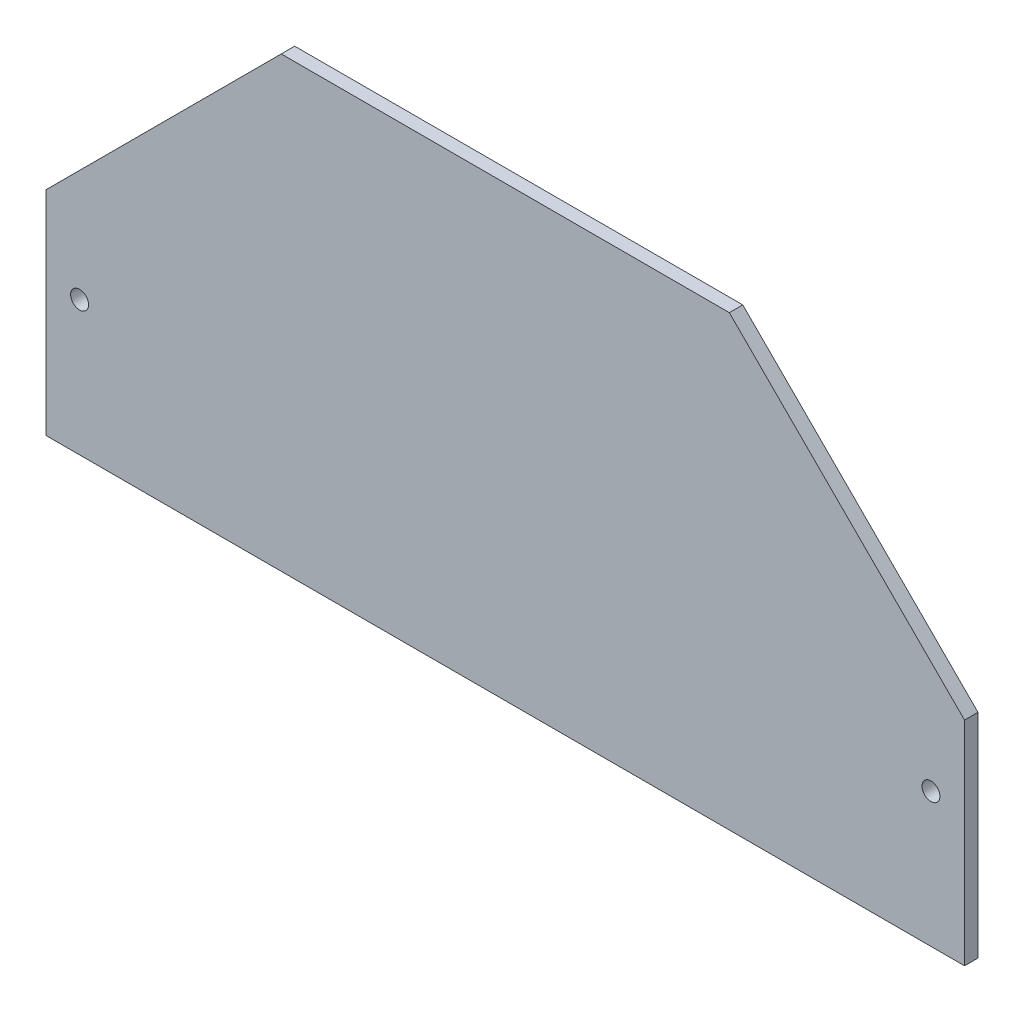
ISO-10303-21;
HEADER;
FILE_DESCRIPTION(('STEP AP214'),'2;1');
FILE_NAME('part.step','',(''),(''),'','','');
FILE_SCHEMA(('AUTOMOTIVE_DESIGN { 1 0 10303 214 1 1 1 1 }'));
ENDSEC;
DATA;
#1=APPLICATION_CONTEXT('core data for automotive mechanical design processes');
#2=APPLICATION_PROTOCOL_DEFINITION('international standard','automotive_design',2000,#1);
#3=PRODUCT_CONTEXT('',#1,'mechanical');
#4=PRODUCT('Part','Part','',(#3));
#5=PRODUCT_RELATED_PRODUCT_CATEGORY('part','',(#4));
#6=PRODUCT_DEFINITION_FORMATION('','',#4);
#7=PRODUCT_DEFINITION_CONTEXT('part definition',#1,'design');
#8=PRODUCT_DEFINITION('design','',#6,#7);
#9=PRODUCT_DEFINITION_SHAPE('','',#8);
#10=(LENGTH_UNIT() NAMED_UNIT(*) SI_UNIT(.MILLI.,.METRE.));
#11=(NAMED_UNIT(*) PLANE_ANGLE_UNIT() SI_UNIT($,.RADIAN.));
#12=(NAMED_UNIT(*) SI_UNIT($,.STERADIAN.) SOLID_ANGLE_UNIT());
#13=UNCERTAINTY_MEASURE_WITH_UNIT(LENGTH_MEASURE(1.E-05),#10,'distance_accuracy_value','');
#14=(GEOMETRIC_REPRESENTATION_CONTEXT(3) GLOBAL_UNCERTAINTY_ASSIGNED_CONTEXT((#13)) GLOBAL_UNIT_ASSIGNED_CONTEXT((#10,
#11,#12)) REPRESENTATION_CONTEXT('',''));
#15=CARTESIAN_POINT('',(0.,0.,0.));
#16=DIRECTION('',(0.,0.,1.));
#17=DIRECTION('',(1.,0.,0.));
#18=AXIS2_PLACEMENT_3D('',#15,#16,#17);
#19=CARTESIAN_POINT('',(0.,0.,15.));
#20=DIRECTION('',(0.,0.,-1.));
#21=DIRECTION('',(-1.,0.,0.));
#22=AXIS2_PLACEMENT_3D('',#19,#20,#21);
#23=PLANE('',#22);
#24=DIRECTION('',(0.,1.,0.));
#25=VECTOR('',#24,1.);
#26=CARTESIAN_POINT('',(512.5,-250.,15.));
#27=LINE('',#26,#25);
#28=CARTESIAN_POINT('',(512.5,-250.,15.));
#29=VERTEX_POINT('',#28);
#30=CARTESIAN_POINT('',(512.5,-12.5000000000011,15.));
#31=VERTEX_POINT('',#30);
#32=EDGE_CURVE('E108',#29,#31,#27,.T.);
#33=ORIENTED_EDGE('',*,*,#32,.T.);
#34=DIRECTION('',(-0.707106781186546,0.707106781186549,0.));
#35=VECTOR('',#34,1.);
#36=CARTESIAN_POINT('',(250.,250.,15.));
#37=LINE('',#36,#35);
#38=CARTESIAN_POINT('',(250.,250.,15.));
#39=VERTEX_POINT('',#38);
#40=EDGE_CURVE('E93',#31,#39,#37,.T.);
#41=ORIENTED_EDGE('',*,*,#40,.T.);
#42=DIRECTION('',(-1.,0.,0.));
#43=VECTOR('',#42,1.);
#44=CARTESIAN_POINT('',(-512.5,250.,15.));
#45=LINE('',#44,#43);
#46=CARTESIAN_POINT('',(-250.,250.,15.));
#47=VERTEX_POINT('',#46);
#48=EDGE_CURVE('E117',#39,#47,#45,.T.);
#49=ORIENTED_EDGE('',*,*,#48,.T.);
#50=DIRECTION('',(-0.707106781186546,-0.707106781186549,0.));
#51=VECTOR('',#50,1.);
#52=CARTESIAN_POINT('',(-512.5,-12.5000000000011,15.));
#53=LINE('',#52,#51);
#54=CARTESIAN_POINT('',(-512.5,-12.5000000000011,15.));
#55=VERTEX_POINT('',#54);
#56=EDGE_CURVE('E102',#47,#55,#53,.T.);
#57=ORIENTED_EDGE('',*,*,#56,.T.);
#58=DIRECTION('',(0.,-1.,0.));
#59=VECTOR('',#58,1.);
#60=CARTESIAN_POINT('',(-512.5,-250.,15.));
#61=LINE('',#60,#59);
#62=CARTESIAN_POINT('',(-512.5,-250.,15.));
#63=VERTEX_POINT('',#62);
#64=EDGE_CURVE('E120',#55,#63,#61,.T.);
#65=ORIENTED_EDGE('',*,*,#64,.T.);
#66=DIRECTION('',(1.,0.,0.));
#67=VECTOR('',#66,1.);
#68=CARTESIAN_POINT('',(-512.5,-250.,15.));
#69=LINE('',#68,#67);
#70=EDGE_CURVE('E115',#63,#29,#69,.T.);
#71=ORIENTED_EDGE('',*,*,#70,.T.);
#72=EDGE_LOOP('',(#33,#41,#49,#57,#65,#71));
#73=FACE_BOUND('',#72,.T.);
#74=CARTESIAN_POINT('',(-475.,-100.,15.));
#75=DIRECTION('',(0.,0.,1.));
#76=DIRECTION('',(1.,0.,0.));
#77=AXIS2_PLACEMENT_3D('',#74,#75,#76);
#78=CIRCLE('',#77,9.99999999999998);
#79=CARTESIAN_POINT('',(-465.,-100.,15.));
#80=VERTEX_POINT('',#79);
#81=EDGE_CURVE('E132',#80,#80,#78,.T.);
#82=ORIENTED_EDGE('',*,*,#81,.F.);
#83=EDGE_LOOP('',(#82));
#84=FACE_BOUND('',#83,.T.);
#85=CARTESIAN_POINT('',(475.,-99.9999999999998,15.));
#86=DIRECTION('',(0.,0.,1.));
#87=DIRECTION('',(1.,0.,0.));
#88=AXIS2_PLACEMENT_3D('',#85,#86,#87);
#89=CIRCLE('',#88,9.99999999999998);
#90=CARTESIAN_POINT('',(485.,-99.9999999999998,15.));
#91=VERTEX_POINT('',#90);
#92=EDGE_CURVE('E151',#91,#91,#89,.T.);
#93=ORIENTED_EDGE('',*,*,#92,.F.);
#94=EDGE_LOOP('',(#93));
#95=FACE_BOUND('',#94,.T.);
#96=ADVANCED_FACE('F42',(#73,#84,#95),#23,.F.);
#97=CARTESIAN_POINT('',(0.,0.,0.));
#98=DIRECTION('',(0.,0.,-1.));
#99=DIRECTION('',(-1.,0.,0.));
#100=AXIS2_PLACEMENT_3D('',#97,#98,#99);
#101=PLANE('',#100);
#102=DIRECTION('',(-0.707106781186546,0.707106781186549,0.));
#103=VECTOR('',#102,1.);
#104=CARTESIAN_POINT('',(250.,250.,0.));
#105=LINE('',#104,#103);
#106=CARTESIAN_POINT('',(512.5,-12.5000000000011,0.));
#107=VERTEX_POINT('',#106);
#108=CARTESIAN_POINT('',(250.,250.,0.));
#109=VERTEX_POINT('',#108);
#110=EDGE_CURVE('E57',#107,#109,#105,.T.);
#111=ORIENTED_EDGE('',*,*,#110,.F.);
#112=DIRECTION('',(0.,1.,0.));
#113=VECTOR('',#112,1.);
#114=CARTESIAN_POINT('',(512.5,-250.,0.));
#115=LINE('',#114,#113);
#116=CARTESIAN_POINT('',(512.5,-250.,0.));
#117=VERTEX_POINT('',#116);
#118=EDGE_CURVE('E110',#117,#107,#115,.T.);
#119=ORIENTED_EDGE('',*,*,#118,.F.);
#120=DIRECTION('',(1.,0.,0.));
#121=VECTOR('',#120,1.);
#122=CARTESIAN_POINT('',(-512.5,-250.,0.));
#123=LINE('',#122,#121);
#124=CARTESIAN_POINT('',(-512.5,-250.,0.));
#125=VERTEX_POINT('',#124);
#126=EDGE_CURVE('E118',#125,#117,#123,.T.);
#127=ORIENTED_EDGE('',*,*,#126,.F.);
#128=DIRECTION('',(0.,-1.,0.));
#129=VECTOR('',#128,1.);
#130=CARTESIAN_POINT('',(-512.5,-250.,0.));
#131=LINE('',#130,#129);
#132=CARTESIAN_POINT('',(-512.5,-12.5000000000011,0.));
#133=VERTEX_POINT('',#132);
#134=EDGE_CURVE('E122',#133,#125,#131,.T.);
#135=ORIENTED_EDGE('',*,*,#134,.F.);
#136=DIRECTION('',(-0.707106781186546,-0.707106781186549,0.));
#137=VECTOR('',#136,1.);
#138=CARTESIAN_POINT('',(-512.5,-12.5000000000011,0.));
#139=LINE('',#138,#137);
#140=CARTESIAN_POINT('',(-250.,250.,0.));
#141=VERTEX_POINT('',#140);
#142=EDGE_CURVE('E65',#141,#133,#139,.T.);
#143=ORIENTED_EDGE('',*,*,#142,.F.);
#144=DIRECTION('',(-1.,0.,0.));
#145=VECTOR('',#144,1.);
#146=CARTESIAN_POINT('',(-512.5,250.,0.));
#147=LINE('',#146,#145);
#148=EDGE_CURVE('E131',#109,#141,#147,.T.);
#149=ORIENTED_EDGE('',*,*,#148,.F.);
#150=EDGE_LOOP('',(#111,#119,#127,#135,#143,#149));
#151=FACE_BOUND('',#150,.T.);
#152=CARTESIAN_POINT('',(-475.,-100.,0.));
#153=DIRECTION('',(0.,0.,1.));
#154=DIRECTION('',(1.,0.,0.));
#155=AXIS2_PLACEMENT_3D('',#152,#153,#154);
#156=CIRCLE('',#155,9.99999999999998);
#157=CARTESIAN_POINT('',(-465.,-100.,0.));
#158=VERTEX_POINT('',#157);
#159=EDGE_CURVE('E125',#158,#158,#156,.T.);
#160=ORIENTED_EDGE('',*,*,#159,.T.);
#161=EDGE_LOOP('',(#160));
#162=FACE_BOUND('',#161,.T.);
#163=CARTESIAN_POINT('',(475.,-99.9999999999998,0.));
#164=DIRECTION('',(0.,0.,1.));
#165=DIRECTION('',(1.,0.,0.));
#166=AXIS2_PLACEMENT_3D('',#163,#164,#165);
#167=CIRCLE('',#166,9.99999999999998);
#168=CARTESIAN_POINT('',(485.,-99.9999999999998,0.));
#169=VERTEX_POINT('',#168);
#170=EDGE_CURVE('E111',#169,#169,#167,.T.);
#171=ORIENTED_EDGE('',*,*,#170,.T.);
#172=EDGE_LOOP('',(#171));
#173=FACE_BOUND('',#172,.T.);
#174=ADVANCED_FACE('F138',(#151,#162,#173),#101,.T.);
#175=CARTESIAN_POINT('',(512.5,-250.,15.));
#176=DIRECTION('',(-1.,0.,0.));
#177=DIRECTION('',(0.,0.,1.));
#178=AXIS2_PLACEMENT_3D('',#175,#176,#177);
#179=PLANE('',#178);
#180=ORIENTED_EDGE('',*,*,#118,.T.);
#181=DIRECTION('',(0.,0.,-1.));
#182=VECTOR('',#181,1.);
#183=CARTESIAN_POINT('',(512.5,-12.5000000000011,15.));
#184=LINE('',#183,#182);
#185=EDGE_CURVE('E96',#31,#107,#184,.T.);
#186=ORIENTED_EDGE('',*,*,#185,.F.);
#187=ORIENTED_EDGE('',*,*,#32,.F.);
#188=DIRECTION('',(0.,0.,-1.));
#189=VECTOR('',#188,1.);
#190=CARTESIAN_POINT('',(512.5,-250.,15.));
#191=LINE('',#190,#189);
#192=EDGE_CURVE('E50',#29,#117,#191,.T.);
#193=ORIENTED_EDGE('',*,*,#192,.T.);
#194=EDGE_LOOP('',(#180,#186,#187,#193));
#195=FACE_BOUND('',#194,.T.);
#196=ADVANCED_FACE('F44',(#195),#179,.F.);
#197=CARTESIAN_POINT('',(-512.5,250.,15.));
#198=DIRECTION('',(0.,-1.,0.));
#199=DIRECTION('',(0.,0.,-1.));
#200=AXIS2_PLACEMENT_3D('',#197,#198,#199);
#201=PLANE('',#200);
#202=ORIENTED_EDGE('',*,*,#48,.F.);
#203=DIRECTION('',(0.,0.,-1.));
#204=VECTOR('',#203,1.);
#205=CARTESIAN_POINT('',(250.,250.,15.));
#206=LINE('',#205,#204);
#207=EDGE_CURVE('E97',#39,#109,#206,.T.);
#208=ORIENTED_EDGE('',*,*,#207,.T.);
#209=ORIENTED_EDGE('',*,*,#148,.T.);
#210=DIRECTION('',(0.,0.,-1.));
#211=VECTOR('',#210,1.);
#212=CARTESIAN_POINT('',(-250.,250.,15.));
#213=LINE('',#212,#211);
#214=EDGE_CURVE('E148',#47,#141,#213,.T.);
#215=ORIENTED_EDGE('',*,*,#214,.F.);
#216=EDGE_LOOP('',(#202,#208,#209,#215));
#217=FACE_BOUND('',#216,.T.);
#218=ADVANCED_FACE('F184',(#217),#201,.F.);
#219=CARTESIAN_POINT('',(-512.5,-250.,15.));
#220=DIRECTION('',(1.,0.,0.));
#221=DIRECTION('',(0.,0.,-1.));
#222=AXIS2_PLACEMENT_3D('',#219,#220,#221);
#223=PLANE('',#222);
#224=ORIENTED_EDGE('',*,*,#64,.F.);
#225=DIRECTION('',(0.,0.,-1.));
#226=VECTOR('',#225,1.);
#227=CARTESIAN_POINT('',(-512.5,-12.5000000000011,15.));
#228=LINE('',#227,#226);
#229=EDGE_CURVE('E146',#55,#133,#228,.T.);
#230=ORIENTED_EDGE('',*,*,#229,.T.);
#231=ORIENTED_EDGE('',*,*,#134,.T.);
#232=DIRECTION('',(0.,0.,-1.));
#233=VECTOR('',#232,1.);
#234=CARTESIAN_POINT('',(-512.5,-250.,15.));
#235=LINE('',#234,#233);
#236=EDGE_CURVE('E12',#63,#125,#235,.T.);
#237=ORIENTED_EDGE('',*,*,#236,.F.);
#238=EDGE_LOOP('',(#224,#230,#231,#237));
#239=FACE_BOUND('',#238,.T.);
#240=ADVANCED_FACE('F174',(#239),#223,.F.);
#241=CARTESIAN_POINT('',(-512.5,-250.,15.));
#242=DIRECTION('',(0.,1.,0.));
#243=DIRECTION('',(0.,0.,1.));
#244=AXIS2_PLACEMENT_3D('',#241,#242,#243);
#245=PLANE('',#244);
#246=ORIENTED_EDGE('',*,*,#126,.T.);
#247=ORIENTED_EDGE('',*,*,#192,.F.);
#248=ORIENTED_EDGE('',*,*,#70,.F.);
#249=ORIENTED_EDGE('',*,*,#236,.T.);
#250=EDGE_LOOP('',(#246,#247,#248,#249));
#251=FACE_BOUND('',#250,.T.);
#252=ADVANCED_FACE('F165',(#251),#245,.F.);
#253=CARTESIAN_POINT('',(-475.,-100.,15.));
#254=DIRECTION('',(0.,0.,-1.));
#255=DIRECTION('',(-1.,0.,0.));
#256=AXIS2_PLACEMENT_3D('',#253,#254,#255);
#257=CYLINDRICAL_SURFACE('',#256,9.99999999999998);
#258=ORIENTED_EDGE('',*,*,#81,.T.);
#259=EDGE_LOOP('',(#258));
#260=FACE_BOUND('',#259,.T.);
#261=ORIENTED_EDGE('',*,*,#159,.F.);
#262=EDGE_LOOP('',(#261));
#263=FACE_BOUND('',#262,.T.);
#264=ADVANCED_FACE('F162',(#260,#263),#257,.F.);
#265=CARTESIAN_POINT('',(475.,-99.9999999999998,15.));
#266=DIRECTION('',(0.,0.,-1.));
#267=DIRECTION('',(-1.,0.,0.));
#268=AXIS2_PLACEMENT_3D('',#265,#266,#267);
#269=CYLINDRICAL_SURFACE('',#268,9.99999999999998);
#270=ORIENTED_EDGE('',*,*,#92,.T.);
#271=EDGE_LOOP('',(#270));
#272=FACE_BOUND('',#271,.T.);
#273=ORIENTED_EDGE('',*,*,#170,.F.);
#274=EDGE_LOOP('',(#273));
#275=FACE_BOUND('',#274,.T.);
#276=ADVANCED_FACE('F164',(#272,#275),#269,.F.);
#277=CARTESIAN_POINT('',(-512.5,-12.5000000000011,15.));
#278=DIRECTION('',(0.707106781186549,-0.707106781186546,0.));
#279=DIRECTION('',(0.707106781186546,0.707106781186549,0.));
#280=AXIS2_PLACEMENT_3D('',#277,#278,#279);
#281=PLANE('',#280);
#282=ORIENTED_EDGE('',*,*,#142,.T.);
#283=ORIENTED_EDGE('',*,*,#229,.F.);
#284=ORIENTED_EDGE('',*,*,#56,.F.);
#285=ORIENTED_EDGE('',*,*,#214,.T.);
#286=EDGE_LOOP('',(#282,#283,#284,#285));
#287=FACE_BOUND('',#286,.T.);
#288=ADVANCED_FACE('F171',(#287),#281,.F.);
#289=CARTESIAN_POINT('',(250.,250.,15.));
#290=DIRECTION('',(-0.707106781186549,-0.707106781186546,0.));
#291=DIRECTION('',(0.707106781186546,-0.707106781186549,0.));
#292=AXIS2_PLACEMENT_3D('',#289,#290,#291);
#293=PLANE('',#292);
#294=ORIENTED_EDGE('',*,*,#110,.T.);
#295=ORIENTED_EDGE('',*,*,#207,.F.);
#296=ORIENTED_EDGE('',*,*,#40,.F.);
#297=ORIENTED_EDGE('',*,*,#185,.T.);
#298=EDGE_LOOP('',(#294,#295,#296,#297));
#299=FACE_BOUND('',#298,.T.);
#300=ADVANCED_FACE('F95',(#299),#293,.F.);
#301=CLOSED_SHELL('',(#96,#174,#196,#218,#240,#252,#264,#276,#288,#300));
#302=MANIFOLD_SOLID_BREP('B2',#301);
#303=ADVANCED_BREP_SHAPE_REPRESENTATION('',(#18,#302),#14);
#304=SHAPE_DEFINITION_REPRESENTATION(#9,#303);
ENDSEC;
END-ISO-10303-21;
